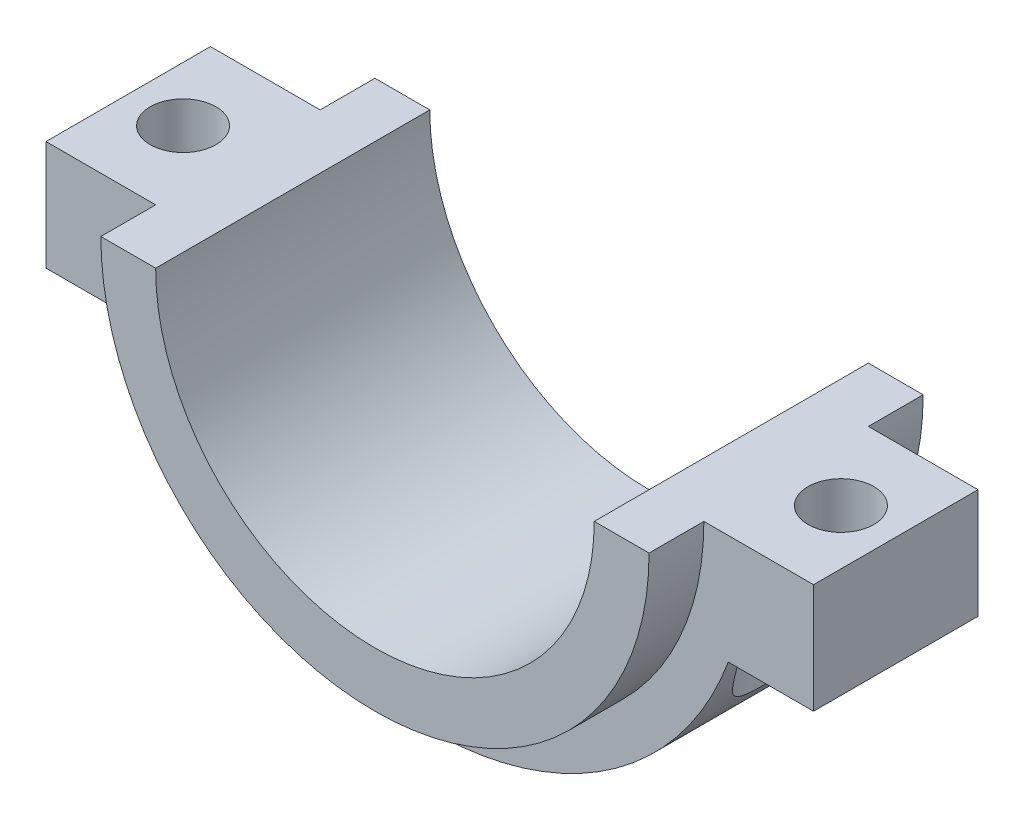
from build123d import *

# Parameters (mm, degrees)
DODANIE_WYCI_GNI_CIE1_DEPTH = 15
DODANIE_WYCI_GNI_CIE2_DEPTH = 25
SZKIC2_R                    = 6
WYTNIJ_WYCI_GNI_CIE1_DEPTH  = 84.480536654
SZKIC2_3_R                  = 14
WYTNIJ_WYCI_GNI_CIE2_DEPTH  = 84.480536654


with BuildPart() as part:
    # Szkic1 → Dodanie-wyci_gni_cie1 (new, symmetric)
    with BuildSketch(Plane.XY):
        with BuildLine():
            ThreePointArc((50, 0), (0, -50), (-50, 0))
            Line((-50, 0), (-70, 0))
            Line((-70, 0), (-70, -20))
            Line((-70, -20), (-54.442630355, -20))
            ThreePointArc((-54.442630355, -20), (0, -58), (54.442630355, -20))
            Line((54.442630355, -20), (70, -20))
            Line((70, -20), (70, 0))
            Line((70, 0), (50, 0))
        make_face()
    extrude(amount=DODANIE_WYCI_GNI_CIE1_DEPTH, both=True)

    # Szkic1_3 → Dodanie-wyci_gni_cie2 (add, symmetric)
    with BuildSketch(Plane.XY):
        with BuildLine():
            ThreePointArc((40, 0), (0, -40), (-40, 0))
            Line((-40, 0), (-50, 0))
            ThreePointArc((-50, 0), (0, -50), (50, 0))
            Line((50, 0), (40, 0))
        make_face()
    extrude(amount=DODANIE_WYCI_GNI_CIE2_DEPTH, both=True)

    # Szkic2 → Wytnij-wyci_gni_cie1 (cut, through all)
    with BuildSketch(Plane.XZ.offset(20)):
        with Locations(Location((-60, 0, 0), (0, 0, 270))):
            Circle(SZKIC2_R)
        with Locations(Location((60, 0, 0), (0, 0, 270))):
            Circle(SZKIC2_R)
    extrude(amount=-WYTNIJ_WYCI_GNI_CIE1_DEPTH, mode=Mode.SUBTRACT)

    # Szkic2_3 → Wytnij-wyci_gni_cie2 (cut, through all)
    with BuildSketch(Plane.XZ.offset(20)):
        with Locations((-60, 0)):
            Circle(SZKIC2_3_R)
        with Locations((60, 0)):
            Circle(SZKIC2_3_R)
    extrude(amount=WYTNIJ_WYCI_GNI_CIE2_DEPTH, mode=Mode.SUBTRACT)


solid = part.part
